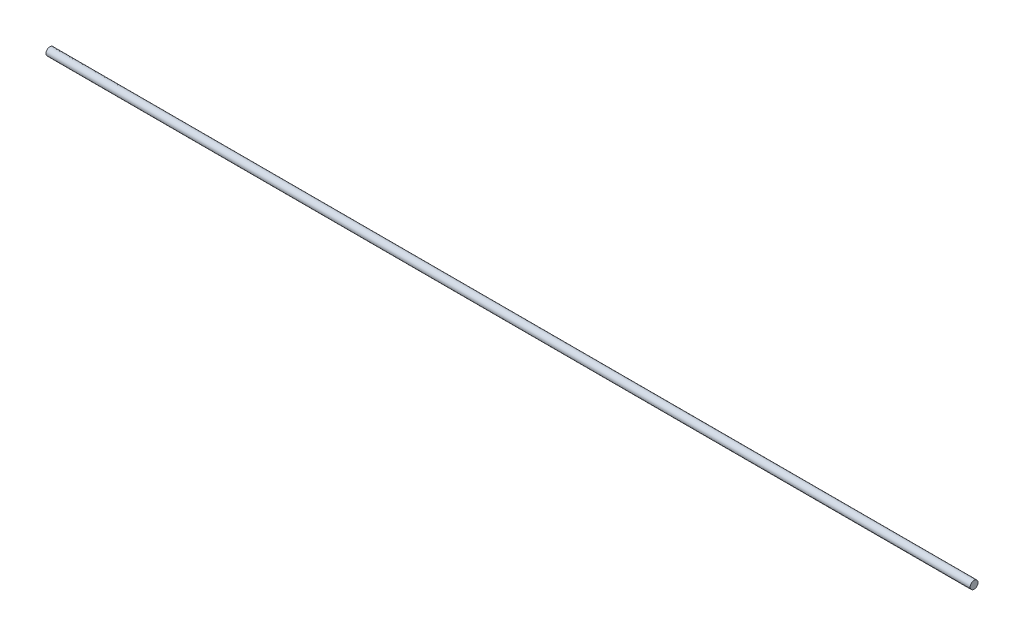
ISO-10303-21;
HEADER;
FILE_DESCRIPTION(('STEP AP214'),'2;1');
FILE_NAME('part.step','',(''),(''),'','','');
FILE_SCHEMA(('AUTOMOTIVE_DESIGN { 1 0 10303 214 1 1 1 1 }'));
ENDSEC;
DATA;
#1=APPLICATION_CONTEXT('core data for automotive mechanical design processes');
#2=APPLICATION_PROTOCOL_DEFINITION('international standard','automotive_design',2000,#1);
#3=PRODUCT_CONTEXT('',#1,'mechanical');
#4=PRODUCT('Part','Part','',(#3));
#5=PRODUCT_RELATED_PRODUCT_CATEGORY('part','',(#4));
#6=PRODUCT_DEFINITION_FORMATION('','',#4);
#7=PRODUCT_DEFINITION_CONTEXT('part definition',#1,'design');
#8=PRODUCT_DEFINITION('design','',#6,#7);
#9=PRODUCT_DEFINITION_SHAPE('','',#8);
#10=(LENGTH_UNIT() NAMED_UNIT(*) SI_UNIT(.MILLI.,.METRE.));
#11=(NAMED_UNIT(*) PLANE_ANGLE_UNIT() SI_UNIT($,.RADIAN.));
#12=(NAMED_UNIT(*) SI_UNIT($,.STERADIAN.) SOLID_ANGLE_UNIT());
#13=UNCERTAINTY_MEASURE_WITH_UNIT(LENGTH_MEASURE(1.E-05),#10,'distance_accuracy_value','');
#14=(GEOMETRIC_REPRESENTATION_CONTEXT(3) GLOBAL_UNCERTAINTY_ASSIGNED_CONTEXT((#13)) GLOBAL_UNIT_ASSIGNED_CONTEXT((#10,
#11,#12)) REPRESENTATION_CONTEXT('',''));
#15=CARTESIAN_POINT('',(0.,0.,0.));
#16=DIRECTION('',(0.,0.,1.));
#17=DIRECTION('',(1.,0.,0.));
#18=AXIS2_PLACEMENT_3D('',#15,#16,#17);
#19=CARTESIAN_POINT('',(1690.35,0.,0.));
#20=DIRECTION('',(-1.,0.,0.));
#21=DIRECTION('',(0.,0.,1.));
#22=AXIS2_PLACEMENT_3D('',#19,#20,#21);
#23=CYLINDRICAL_SURFACE('',#22,14.3256);
#24=CARTESIAN_POINT('',(1690.35,0.,0.));
#25=DIRECTION('',(1.,0.,0.));
#26=DIRECTION('',(0.,0.,-1.));
#27=AXIS2_PLACEMENT_3D('',#24,#25,#26);
#28=CIRCLE('',#27,14.3256);
#29=CARTESIAN_POINT('',(1690.35,0.,14.3256));
#30=VERTEX_POINT('',#29);
#31=EDGE_CURVE('E10',#30,#30,#28,.T.);
#32=CARTESIAN_POINT('',(-1690.35,0.,0.));
#33=DIRECTION('',(1.,0.,0.));
#34=DIRECTION('',(0.,0.,-1.));
#35=AXIS2_PLACEMENT_3D('',#32,#33,#34);
#36=CIRCLE('',#35,14.3256);
#37=CARTESIAN_POINT('',(-1690.35,0.,14.3256));
#38=VERTEX_POINT('',#37);
#39=EDGE_CURVE('E46',#38,#38,#36,.T.);
#40=CARTESIAN_POINT('',(1690.35,0.,14.3256));
#41=CARTESIAN_POINT('',(1655.134375,0.,14.3256));
#42=CARTESIAN_POINT('',(1619.91875,0.,14.3256));
#43=CARTESIAN_POINT('',(1549.4875,0.,14.3256));
#44=CARTESIAN_POINT('',(1514.271875,0.,14.3256));
#45=CARTESIAN_POINT('',(1443.840625,0.,14.3256));
#46=CARTESIAN_POINT('',(1408.625,0.,14.3256));
#47=CARTESIAN_POINT('',(1338.19375,0.,14.3256));
#48=CARTESIAN_POINT('',(1302.978125,0.,14.3256));
#49=CARTESIAN_POINT('',(1232.546875,0.,14.3256));
#50=CARTESIAN_POINT('',(1197.33125,0.,14.3256));
#51=CARTESIAN_POINT('',(1126.9,0.,14.3256));
#52=CARTESIAN_POINT('',(1091.684375,0.,14.3256));
#53=CARTESIAN_POINT('',(1021.253125,0.,14.3256));
#54=CARTESIAN_POINT('',(986.0375,0.,14.3256));
#55=CARTESIAN_POINT('',(915.60625,0.,14.3256));
#56=CARTESIAN_POINT('',(880.390625,0.,14.3256));
#57=CARTESIAN_POINT('',(809.959375,0.,14.3256));
#58=CARTESIAN_POINT('',(774.74375,0.,14.3256));
#59=CARTESIAN_POINT('',(704.3125,0.,14.3256));
#60=CARTESIAN_POINT('',(669.096875,0.,14.3256));
#61=CARTESIAN_POINT('',(598.665625,0.,14.3256));
#62=CARTESIAN_POINT('',(563.45,0.,14.3256));
#63=CARTESIAN_POINT('',(493.01875,0.,14.3256));
#64=CARTESIAN_POINT('',(457.803125,0.,14.3256));
#65=CARTESIAN_POINT('',(387.371875,0.,14.3256));
#66=CARTESIAN_POINT('',(352.15625,0.,14.3256));
#67=CARTESIAN_POINT('',(281.725,0.,14.3256));
#68=CARTESIAN_POINT('',(246.509375,0.,14.3256));
#69=CARTESIAN_POINT('',(176.078125,0.,14.3256));
#70=CARTESIAN_POINT('',(140.8625,0.,14.3256));
#71=CARTESIAN_POINT('',(70.4312499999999,0.,14.3256));
#72=CARTESIAN_POINT('',(35.2156249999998,0.,14.3256));
#73=CARTESIAN_POINT('',(-35.2156250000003,0.,14.3256));
#74=CARTESIAN_POINT('',(-70.4312500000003,0.,14.3256));
#75=CARTESIAN_POINT('',(-140.8625,0.,14.3256));
#76=CARTESIAN_POINT('',(-176.078125,0.,14.3256));
#77=CARTESIAN_POINT('',(-246.509375,0.,14.3256));
#78=CARTESIAN_POINT('',(-281.725,0.,14.3256));
#79=CARTESIAN_POINT('',(-352.15625,0.,14.3256));
#80=CARTESIAN_POINT('',(-387.371875,0.,14.3256));
#81=CARTESIAN_POINT('',(-457.803125,0.,14.3256));
#82=CARTESIAN_POINT('',(-493.01875,0.,14.3256));
#83=CARTESIAN_POINT('',(-563.45,0.,14.3256));
#84=CARTESIAN_POINT('',(-598.665625,0.,14.3256));
#85=CARTESIAN_POINT('',(-669.096875,0.,14.3256));
#86=CARTESIAN_POINT('',(-704.3125,0.,14.3256));
#87=CARTESIAN_POINT('',(-774.74375,0.,14.3256));
#88=CARTESIAN_POINT('',(-809.959375,0.,14.3256));
#89=CARTESIAN_POINT('',(-880.390625,0.,14.3256));
#90=CARTESIAN_POINT('',(-915.60625,0.,14.3256));
#91=CARTESIAN_POINT('',(-986.0375,0.,14.3256));
#92=CARTESIAN_POINT('',(-1021.253125,0.,14.3256));
#93=CARTESIAN_POINT('',(-1091.684375,0.,14.3256));
#94=CARTESIAN_POINT('',(-1126.9,0.,14.3256));
#95=CARTESIAN_POINT('',(-1197.33125,0.,14.3256));
#96=CARTESIAN_POINT('',(-1232.546875,0.,14.3256));
#97=CARTESIAN_POINT('',(-1302.978125,0.,14.3256));
#98=CARTESIAN_POINT('',(-1338.19375,0.,14.3256));
#99=CARTESIAN_POINT('',(-1408.625,0.,14.3256));
#100=CARTESIAN_POINT('',(-1443.840625,0.,14.3256));
#101=CARTESIAN_POINT('',(-1514.271875,0.,14.3256));
#102=CARTESIAN_POINT('',(-1549.4875,0.,14.3256));
#103=CARTESIAN_POINT('',(-1619.91875,0.,14.3256));
#104=CARTESIAN_POINT('',(-1655.134375,0.,14.3256));
#105=CARTESIAN_POINT('',(-1690.35,0.,14.3256));
#106=B_SPLINE_CURVE_WITH_KNOTS('',3,(#40,#41,#42,#43,#44,#45,#46,#47,#48,#49,#50,#51,#52,#53,
#54,#55,#56,#57,#58,#59,#60,#61,#62,#63,#64,#65,#66,#67,#68,#69,#70,#71,#72,#73,#74,#75,#76,#77,
#78,#79,#80,#81,#82,#83,#84,#85,#86,#87,#88,#89,#90,#91,#92,#93,#94,#95,#96,#97,#98,#99,#100,
#101,#102,#103,#104,#105),.UNSPECIFIED.,.F.,.F.,(4,2,2,2,2,2,2,2,2,2,2,2,2,2,2,2,2,2,2,2,2,2,2,
2,2,2,2,2,2,2,2,2,4),(0.,105.646875,211.29375,316.940625,422.5875,528.234375,633.88125,
739.528125,845.175,950.821875,1056.46875,1162.115625,1267.7625,1373.409375,1479.05625,
1584.703125,1690.35,1795.996875,1901.64375,2007.290625,2112.9375,2218.584375,2324.23125,
2429.878125,2535.525,2641.171875,2746.81875,2852.465625,2958.1125,3063.759375,3169.40625,
3275.053125,3380.7),.UNSPECIFIED.);
#107=EDGE_CURVE('BSEAM43',#30,#38,#106,.T.);
#108=ORIENTED_EDGE('',*,*,#31,.F.);
#109=ORIENTED_EDGE('',*,*,#39,.T.);
#110=ORIENTED_EDGE('',*,*,#107,.T.);
#111=ORIENTED_EDGE('',*,*,#107,.F.);
#112=EDGE_LOOP('',(#108,#110,#109,#111));
#113=FACE_BOUND('',#112,.T.);
#114=ADVANCED_FACE('F43',(#113),#23,.T.);
#115=CARTESIAN_POINT('',(1690.35,0.,0.));
#116=DIRECTION('',(1.,0.,0.));
#117=DIRECTION('',(0.,0.,-1.));
#118=AXIS2_PLACEMENT_3D('',#115,#116,#117);
#119=PLANE('',#118);
#120=ORIENTED_EDGE('',*,*,#31,.T.);
#121=EDGE_LOOP('',(#120));
#122=FACE_BOUND('',#121,.T.);
#123=ADVANCED_FACE('F58',(#122),#119,.T.);
#124=CARTESIAN_POINT('',(-1690.35,0.,0.));
#125=DIRECTION('',(1.,0.,0.));
#126=DIRECTION('',(0.,0.,-1.));
#127=AXIS2_PLACEMENT_3D('',#124,#125,#126);
#128=PLANE('',#127);
#129=ORIENTED_EDGE('',*,*,#39,.F.);
#130=EDGE_LOOP('',(#129));
#131=FACE_BOUND('',#130,.T.);
#132=ADVANCED_FACE('F59',(#131),#128,.F.);
#133=CLOSED_SHELL('',(#114,#123,#132));
#134=MANIFOLD_SOLID_BREP('B2',#133);
#135=ADVANCED_BREP_SHAPE_REPRESENTATION('',(#18,#134),#14);
#136=SHAPE_DEFINITION_REPRESENTATION(#9,#135);
ENDSEC;
END-ISO-10303-21;
